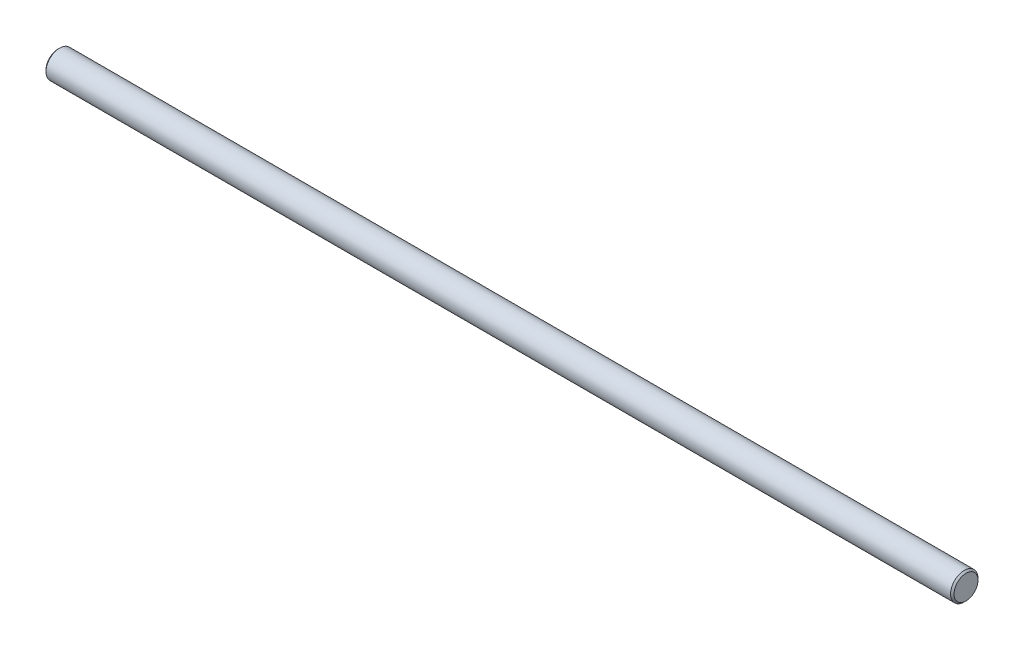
ISO-10303-21;
HEADER;
FILE_DESCRIPTION(('STEP AP214'),'2;1');
FILE_NAME('part.step','',(''),(''),'','','');
FILE_SCHEMA(('AUTOMOTIVE_DESIGN { 1 0 10303 214 1 1 1 1 }'));
ENDSEC;
DATA;
#1=APPLICATION_CONTEXT('core data for automotive mechanical design processes');
#2=APPLICATION_PROTOCOL_DEFINITION('international standard','automotive_design',2000,#1);
#3=PRODUCT_CONTEXT('',#1,'mechanical');
#4=PRODUCT('Part','Part','',(#3));
#5=PRODUCT_RELATED_PRODUCT_CATEGORY('part','',(#4));
#6=PRODUCT_DEFINITION_FORMATION('','',#4);
#7=PRODUCT_DEFINITION_CONTEXT('part definition',#1,'design');
#8=PRODUCT_DEFINITION('design','',#6,#7);
#9=PRODUCT_DEFINITION_SHAPE('','',#8);
#10=(LENGTH_UNIT() NAMED_UNIT(*) SI_UNIT(.MILLI.,.METRE.));
#11=(NAMED_UNIT(*) PLANE_ANGLE_UNIT() SI_UNIT($,.RADIAN.));
#12=(NAMED_UNIT(*) SI_UNIT($,.STERADIAN.) SOLID_ANGLE_UNIT());
#13=UNCERTAINTY_MEASURE_WITH_UNIT(LENGTH_MEASURE(1.E-05),#10,'distance_accuracy_value','');
#14=(GEOMETRIC_REPRESENTATION_CONTEXT(3) GLOBAL_UNCERTAINTY_ASSIGNED_CONTEXT((#13)) GLOBAL_UNIT_ASSIGNED_CONTEXT((#10,
#11,#12)) REPRESENTATION_CONTEXT('',''));
#15=CARTESIAN_POINT('',(0.,0.,0.));
#16=DIRECTION('',(0.,0.,1.));
#17=DIRECTION('',(1.,0.,0.));
#18=AXIS2_PLACEMENT_3D('',#15,#16,#17);
#19=CARTESIAN_POINT('',(132.5,0.,0.));
#20=DIRECTION('',(1.,0.,0.));
#21=DIRECTION('',(0.,0.,-1.));
#22=AXIS2_PLACEMENT_3D('',#19,#20,#21);
#23=PLANE('',#22);
#24=CARTESIAN_POINT('',(132.499999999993,0.,0.));
#25=DIRECTION('',(-1.,0.,0.));
#26=DIRECTION('',(0.,0.,1.));
#27=AXIS2_PLACEMENT_3D('',#24,#25,#26);
#28=CIRCLE('',#27,3.50000000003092);
#29=CARTESIAN_POINT('',(132.499999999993,0.,3.50000000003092));
#30=VERTEX_POINT('',#29);
#31=EDGE_CURVE('E18',#30,#30,#28,.T.);
#32=ORIENTED_EDGE('',*,*,#31,.F.);
#33=EDGE_LOOP('',(#32));
#34=FACE_BOUND('',#33,.T.);
#35=ADVANCED_FACE('F15',(#34),#23,.T.);
#36=CARTESIAN_POINT('',(-132.5,0.,0.));
#37=DIRECTION('',(1.,0.,0.));
#38=DIRECTION('',(0.,0.,-1.));
#39=AXIS2_PLACEMENT_3D('',#36,#37,#38);
#40=PLANE('',#39);
#41=CARTESIAN_POINT('',(-132.499999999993,0.,0.));
#42=DIRECTION('',(1.,0.,0.));
#43=DIRECTION('',(0.,0.,-1.));
#44=AXIS2_PLACEMENT_3D('',#41,#42,#43);
#45=CIRCLE('',#44,3.50000000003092);
#46=CARTESIAN_POINT('',(-132.499999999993,0.,-3.50000000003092));
#47=VERTEX_POINT('',#46);
#48=EDGE_CURVE('E31',#47,#47,#45,.T.);
#49=ORIENTED_EDGE('',*,*,#48,.F.);
#50=EDGE_LOOP('',(#49));
#51=FACE_BOUND('',#50,.T.);
#52=ADVANCED_FACE('F43',(#51),#40,.F.);
#53=CARTESIAN_POINT('',(132.000000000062,0.,0.));
#54=DIRECTION('',(-1.,0.,0.));
#55=DIRECTION('',(0.,0.,1.));
#56=AXIS2_PLACEMENT_3D('',#53,#54,#55);
#57=CONICAL_SURFACE('',#56,3.99999999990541,0.785398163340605);
#58=CARTESIAN_POINT('',(132.,0.,0.));
#59=DIRECTION('',(1.,0.,0.));
#60=DIRECTION('',(0.,0.,-1.));
#61=AXIS2_PLACEMENT_3D('',#58,#59,#60);
#62=CIRCLE('',#61,4.);
#63=CARTESIAN_POINT('',(132.,0.,-4.));
#64=VERTEX_POINT('',#63);
#65=EDGE_CURVE('E23',#64,#64,#62,.F.);
#66=ORIENTED_EDGE('',*,*,#65,.F.);
#67=EDGE_LOOP('',(#66));
#68=FACE_BOUND('',#67,.T.);
#69=ORIENTED_EDGE('',*,*,#31,.T.);
#70=EDGE_LOOP('',(#69));
#71=FACE_BOUND('',#70,.T.);
#72=ADVANCED_FACE('F40',(#68,#71),#57,.T.);
#73=CARTESIAN_POINT('',(-132.000000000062,0.,0.));
#74=DIRECTION('',(1.,0.,0.));
#75=DIRECTION('',(0.,0.,-1.));
#76=AXIS2_PLACEMENT_3D('',#73,#74,#75);
#77=CONICAL_SURFACE('',#76,3.99999999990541,0.785398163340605);
#78=CARTESIAN_POINT('',(-132.,0.,0.));
#79=DIRECTION('',(1.,0.,0.));
#80=DIRECTION('',(0.,0.,-1.));
#81=AXIS2_PLACEMENT_3D('',#78,#79,#80);
#82=CIRCLE('',#81,4.);
#83=CARTESIAN_POINT('',(-132.,0.,-4.));
#84=VERTEX_POINT('',#83);
#85=EDGE_CURVE('E10',#84,#84,#82,.T.);
#86=ORIENTED_EDGE('',*,*,#85,.F.);
#87=EDGE_LOOP('',(#86));
#88=FACE_BOUND('',#87,.T.);
#89=ORIENTED_EDGE('',*,*,#48,.T.);
#90=EDGE_LOOP('',(#89));
#91=FACE_BOUND('',#90,.T.);
#92=ADVANCED_FACE('F51',(#88,#91),#77,.T.);
#93=CARTESIAN_POINT('',(-132.5,0.,0.));
#94=DIRECTION('',(1.,0.,0.));
#95=DIRECTION('',(0.,0.,-1.));
#96=AXIS2_PLACEMENT_3D('',#93,#94,#95);
#97=CYLINDRICAL_SURFACE('',#96,4.);
#98=ORIENTED_EDGE('',*,*,#65,.T.);
#99=EDGE_LOOP('',(#98));
#100=FACE_BOUND('',#99,.T.);
#101=ORIENTED_EDGE('',*,*,#85,.T.);
#102=EDGE_LOOP('',(#101));
#103=FACE_BOUND('',#102,.T.);
#104=ADVANCED_FACE('F49',(#100,#103),#97,.T.);
#105=CLOSED_SHELL('',(#35,#52,#72,#92,#104));
#106=MANIFOLD_SOLID_BREP('B1',#105);
#107=ADVANCED_BREP_SHAPE_REPRESENTATION('',(#18,#106),#14);
#108=SHAPE_DEFINITION_REPRESENTATION(#9,#107);
ENDSEC;
END-ISO-10303-21;
